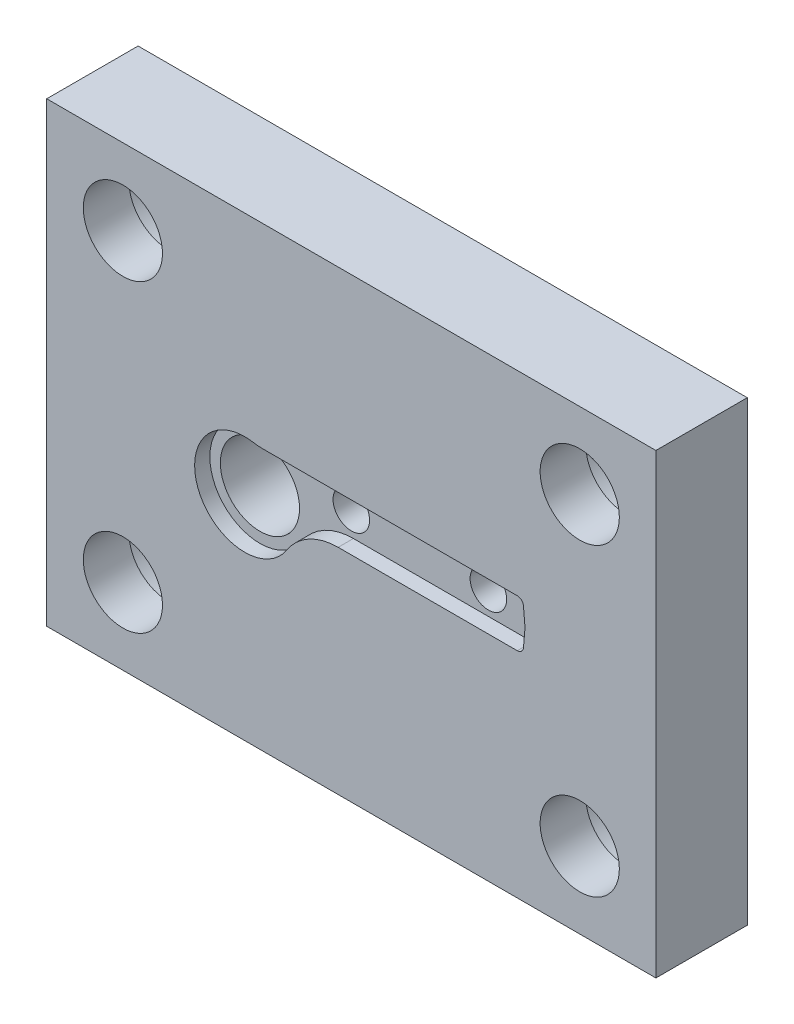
ISO-10303-21;
HEADER;
FILE_DESCRIPTION(('STEP AP214'),'2;1');
FILE_NAME('part.step','',(''),(''),'','','');
FILE_SCHEMA(('AUTOMOTIVE_DESIGN { 1 0 10303 214 1 1 1 1 }'));
ENDSEC;
DATA;
#1=APPLICATION_CONTEXT('core data for automotive mechanical design processes');
#2=APPLICATION_PROTOCOL_DEFINITION('international standard','automotive_design',2000,#1);
#3=PRODUCT_CONTEXT('',#1,'mechanical');
#4=PRODUCT('Part','Part','',(#3));
#5=PRODUCT_RELATED_PRODUCT_CATEGORY('part','',(#4));
#6=PRODUCT_DEFINITION_FORMATION('','',#4);
#7=PRODUCT_DEFINITION_CONTEXT('part definition',#1,'design');
#8=PRODUCT_DEFINITION('design','',#6,#7);
#9=PRODUCT_DEFINITION_SHAPE('','',#8);
#10=(LENGTH_UNIT() NAMED_UNIT(*) SI_UNIT(.MILLI.,.METRE.));
#11=(NAMED_UNIT(*) PLANE_ANGLE_UNIT() SI_UNIT($,.RADIAN.));
#12=(NAMED_UNIT(*) SI_UNIT($,.STERADIAN.) SOLID_ANGLE_UNIT());
#13=UNCERTAINTY_MEASURE_WITH_UNIT(LENGTH_MEASURE(1.E-05),#10,'distance_accuracy_value','');
#14=(GEOMETRIC_REPRESENTATION_CONTEXT(3) GLOBAL_UNCERTAINTY_ASSIGNED_CONTEXT((#13)) GLOBAL_UNIT_ASSIGNED_CONTEXT((#10,
#11,#12)) REPRESENTATION_CONTEXT('',''));
#15=CARTESIAN_POINT('',(0.,0.,0.));
#16=DIRECTION('',(0.,0.,1.));
#17=DIRECTION('',(1.,0.,0.));
#18=AXIS2_PLACEMENT_3D('',#15,#16,#17);
#19=CARTESIAN_POINT('',(0.,0.,30.));
#20=DIRECTION('',(1.,0.,0.));
#21=DIRECTION('',(0.,0.,-1.));
#22=AXIS2_PLACEMENT_3D('',#19,#20,#21);
#23=PLANE('',#22);
#24=DIRECTION('',(0.,-1.,0.));
#25=VECTOR('',#24,1.);
#26=CARTESIAN_POINT('',(0.,0.,0.));
#27=LINE('',#26,#25);
#28=CARTESIAN_POINT('',(0.,150.,0.));
#29=VERTEX_POINT('',#28);
#30=CARTESIAN_POINT('',(0.,0.,0.));
#31=VERTEX_POINT('',#30);
#32=EDGE_CURVE('E191',#29,#31,#27,.T.);
#33=ORIENTED_EDGE('',*,*,#32,.T.);
#34=DIRECTION('',(0.,0.,-1.));
#35=VECTOR('',#34,1.);
#36=CARTESIAN_POINT('',(0.,0.,30.));
#37=LINE('',#36,#35);
#38=CARTESIAN_POINT('',(0.,0.,30.));
#39=VERTEX_POINT('',#38);
#40=EDGE_CURVE('E11',#39,#31,#37,.T.);
#41=ORIENTED_EDGE('',*,*,#40,.F.);
#42=DIRECTION('',(0.,-1.,0.));
#43=VECTOR('',#42,1.);
#44=CARTESIAN_POINT('',(0.,0.,30.));
#45=LINE('',#44,#43);
#46=CARTESIAN_POINT('',(0.,150.,30.));
#47=VERTEX_POINT('',#46);
#48=EDGE_CURVE('E212',#47,#39,#45,.T.);
#49=ORIENTED_EDGE('',*,*,#48,.F.);
#50=DIRECTION('',(0.,0.,-1.));
#51=VECTOR('',#50,1.);
#52=CARTESIAN_POINT('',(0.,150.,30.));
#53=LINE('',#52,#51);
#54=EDGE_CURVE('E219',#47,#29,#53,.T.);
#55=ORIENTED_EDGE('',*,*,#54,.T.);
#56=EDGE_LOOP('',(#33,#41,#49,#55));
#57=FACE_BOUND('',#56,.T.);
#58=ADVANCED_FACE('F28',(#57),#23,.F.);
#59=CARTESIAN_POINT('',(0.,0.,30.));
#60=DIRECTION('',(0.,1.,0.));
#61=DIRECTION('',(0.,0.,1.));
#62=AXIS2_PLACEMENT_3D('',#59,#60,#61);
#63=PLANE('',#62);
#64=DIRECTION('',(1.,0.,0.));
#65=VECTOR('',#64,1.);
#66=CARTESIAN_POINT('',(0.,0.,0.));
#67=LINE('',#66,#65);
#68=CARTESIAN_POINT('',(200.,0.,0.));
#69=VERTEX_POINT('',#68);
#70=EDGE_CURVE('E206',#31,#69,#67,.T.);
#71=ORIENTED_EDGE('',*,*,#70,.T.);
#72=DIRECTION('',(0.,0.,-1.));
#73=VECTOR('',#72,1.);
#74=CARTESIAN_POINT('',(200.,0.,30.));
#75=LINE('',#74,#73);
#76=CARTESIAN_POINT('',(200.,0.,30.));
#77=VERTEX_POINT('',#76);
#78=EDGE_CURVE('E35',#77,#69,#75,.T.);
#79=ORIENTED_EDGE('',*,*,#78,.F.);
#80=DIRECTION('',(1.,0.,0.));
#81=VECTOR('',#80,1.);
#82=CARTESIAN_POINT('',(0.,0.,30.));
#83=LINE('',#82,#81);
#84=EDGE_CURVE('E214',#39,#77,#83,.T.);
#85=ORIENTED_EDGE('',*,*,#84,.F.);
#86=ORIENTED_EDGE('',*,*,#40,.T.);
#87=EDGE_LOOP('',(#71,#79,#85,#86));
#88=FACE_BOUND('',#87,.T.);
#89=ADVANCED_FACE('F241',(#88),#63,.F.);
#90=CARTESIAN_POINT('',(200.,0.,30.));
#91=DIRECTION('',(-1.,0.,0.));
#92=DIRECTION('',(0.,0.,1.));
#93=AXIS2_PLACEMENT_3D('',#90,#91,#92);
#94=PLANE('',#93);
#95=DIRECTION('',(0.,1.,0.));
#96=VECTOR('',#95,1.);
#97=CARTESIAN_POINT('',(200.,0.,0.));
#98=LINE('',#97,#96);
#99=CARTESIAN_POINT('',(200.,150.,0.));
#100=VERTEX_POINT('',#99);
#101=EDGE_CURVE('E208',#69,#100,#98,.T.);
#102=ORIENTED_EDGE('',*,*,#101,.T.);
#103=DIRECTION('',(0.,0.,-1.));
#104=VECTOR('',#103,1.);
#105=CARTESIAN_POINT('',(200.,150.,30.));
#106=LINE('',#105,#104);
#107=CARTESIAN_POINT('',(200.,150.,30.));
#108=VERTEX_POINT('',#107);
#109=EDGE_CURVE('E222',#108,#100,#106,.T.);
#110=ORIENTED_EDGE('',*,*,#109,.F.);
#111=DIRECTION('',(0.,1.,0.));
#112=VECTOR('',#111,1.);
#113=CARTESIAN_POINT('',(200.,0.,30.));
#114=LINE('',#113,#112);
#115=EDGE_CURVE('E216',#77,#108,#114,.T.);
#116=ORIENTED_EDGE('',*,*,#115,.F.);
#117=ORIENTED_EDGE('',*,*,#78,.T.);
#118=EDGE_LOOP('',(#102,#110,#116,#117));
#119=FACE_BOUND('',#118,.T.);
#120=ADVANCED_FACE('F229',(#119),#94,.F.);
#121=CARTESIAN_POINT('',(0.,150.,30.));
#122=DIRECTION('',(0.,-1.,0.));
#123=DIRECTION('',(0.,0.,-1.));
#124=AXIS2_PLACEMENT_3D('',#121,#122,#123);
#125=PLANE('',#124);
#126=DIRECTION('',(-1.,0.,0.));
#127=VECTOR('',#126,1.);
#128=CARTESIAN_POINT('',(0.,150.,0.));
#129=LINE('',#128,#127);
#130=EDGE_CURVE('E210',#100,#29,#129,.T.);
#131=ORIENTED_EDGE('',*,*,#130,.T.);
#132=ORIENTED_EDGE('',*,*,#54,.F.);
#133=DIRECTION('',(-1.,0.,0.));
#134=VECTOR('',#133,1.);
#135=CARTESIAN_POINT('',(0.,150.,30.));
#136=LINE('',#135,#134);
#137=EDGE_CURVE('E50',#108,#47,#136,.T.);
#138=ORIENTED_EDGE('',*,*,#137,.F.);
#139=ORIENTED_EDGE('',*,*,#109,.T.);
#140=EDGE_LOOP('',(#131,#132,#138,#139));
#141=FACE_BOUND('',#140,.T.);
#142=ADVANCED_FACE('F237',(#141),#125,.F.);
#143=CARTESIAN_POINT('',(0.,150.,30.));
#144=DIRECTION('',(0.,0.,-1.));
#145=DIRECTION('',(-1.,0.,0.));
#146=AXIS2_PLACEMENT_3D('',#143,#144,#145);
#147=PLANE('',#146);
#148=CARTESIAN_POINT('',(175.,125.,30.));
#149=DIRECTION('',(0.,0.,1.));
#150=DIRECTION('',(1.,0.,0.));
#151=AXIS2_PLACEMENT_3D('',#148,#149,#150);
#152=CIRCLE('',#151,13.);
#153=CARTESIAN_POINT('',(188.,125.,30.));
#154=VERTEX_POINT('',#153);
#155=EDGE_CURVE('E409',#154,#154,#152,.T.);
#156=ORIENTED_EDGE('',*,*,#155,.F.);
#157=EDGE_LOOP('',(#156));
#158=FACE_BOUND('',#157,.T.);
#159=CARTESIAN_POINT('',(175.,25.,30.));
#160=DIRECTION('',(0.,0.,1.));
#161=DIRECTION('',(1.,0.,0.));
#162=AXIS2_PLACEMENT_3D('',#159,#160,#161);
#163=CIRCLE('',#162,13.);
#164=CARTESIAN_POINT('',(188.,25.,30.));
#165=VERTEX_POINT('',#164);
#166=EDGE_CURVE('E412',#165,#165,#163,.T.);
#167=ORIENTED_EDGE('',*,*,#166,.F.);
#168=EDGE_LOOP('',(#167));
#169=FACE_BOUND('',#168,.T.);
#170=CARTESIAN_POINT('',(25.,25.,30.));
#171=DIRECTION('',(0.,0.,1.));
#172=DIRECTION('',(1.,0.,0.));
#173=AXIS2_PLACEMENT_3D('',#170,#171,#172);
#174=CIRCLE('',#173,13.);
#175=CARTESIAN_POINT('',(38.,25.,30.));
#176=VERTEX_POINT('',#175);
#177=EDGE_CURVE('E415',#176,#176,#174,.T.);
#178=ORIENTED_EDGE('',*,*,#177,.F.);
#179=EDGE_LOOP('',(#178));
#180=FACE_BOUND('',#179,.T.);
#181=CARTESIAN_POINT('',(25.,125.,30.));
#182=DIRECTION('',(0.,0.,1.));
#183=DIRECTION('',(1.,0.,0.));
#184=AXIS2_PLACEMENT_3D('',#181,#182,#183);
#185=CIRCLE('',#184,13.);
#186=CARTESIAN_POINT('',(38.,125.,30.));
#187=VERTEX_POINT('',#186);
#188=EDGE_CURVE('E418',#187,#187,#185,.T.);
#189=ORIENTED_EDGE('',*,*,#188,.F.);
#190=EDGE_LOOP('',(#189));
#191=FACE_BOUND('',#190,.T.);
#192=CARTESIAN_POINT('',(65.,70.,30.));
#193=DIRECTION('',(0.,0.,1.));
#194=DIRECTION('',(1.,0.,0.));
#195=AXIS2_PLACEMENT_3D('',#192,#193,#194);
#196=CIRCLE('',#195,16.445);
#197=CARTESIAN_POINT('',(67.7403932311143,86.2150630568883,30.));
#198=VERTEX_POINT('',#197);
#199=CARTESIAN_POINT('',(78.8329287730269,61.1068505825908,30.));
#200=VERTEX_POINT('',#199);
#201=EDGE_CURVE('E138',#198,#200,#196,.T.);
#202=ORIENTED_EDGE('',*,*,#201,.F.);
#203=CARTESIAN_POINT('',(71.0781905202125,105.965,30.));
#204=DIRECTION('',(0.,0.,-1.));
#205=DIRECTION('',(-1.,0.,0.));
#206=AXIS2_PLACEMENT_3D('',#203,#204,#205);
#207=CIRCLE('',#206,20.03);
#208=CARTESIAN_POINT('',(71.0781905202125,85.935,30.));
#209=VERTEX_POINT('',#208);
#210=EDGE_CURVE('E42',#209,#198,#207,.T.);
#211=ORIENTED_EDGE('',*,*,#210,.F.);
#212=DIRECTION('',(-1.,0.,0.));
#213=VECTOR('',#212,1.);
#214=CARTESIAN_POINT('',(71.0781905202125,85.935,30.));
#215=LINE('',#214,#213);
#216=CARTESIAN_POINT('',(154.489847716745,85.935,30.));
#217=VERTEX_POINT('',#216);
#218=EDGE_CURVE('E162',#217,#209,#215,.T.);
#219=ORIENTED_EDGE('',*,*,#218,.F.);
#220=CARTESIAN_POINT('',(154.489847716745,83.905,30.));
#221=DIRECTION('',(0.,0.,1.));
#222=DIRECTION('',(-1.,0.,0.));
#223=AXIS2_PLACEMENT_3D('',#220,#221,#222);
#224=CIRCLE('',#223,2.03000000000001);
#225=CARTESIAN_POINT('',(156.512122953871,84.0819261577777,30.));
#226=VERTEX_POINT('',#225);
#227=EDGE_CURVE('E159',#226,#217,#224,.T.);
#228=ORIENTED_EDGE('',*,*,#227,.F.);
#229=DIRECTION('',(-0.0871557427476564,0.996194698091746,0.));
#230=VECTOR('',#229,1.);
#231=CARTESIAN_POINT('',(156.512122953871,84.0819261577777,30.));
#232=LINE('',#231,#230);
#233=CARTESIAN_POINT('',(157.033723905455,78.12,30.));
#234=VERTEX_POINT('',#233);
#235=EDGE_CURVE('E156',#234,#226,#232,.T.);
#236=ORIENTED_EDGE('',*,*,#235,.F.);
#237=DIRECTION('',(0.0871557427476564,0.996194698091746,0.));
#238=VECTOR('',#237,1.);
#239=CARTESIAN_POINT('',(156.512122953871,72.1580738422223,30.));
#240=LINE('',#239,#238);
#241=CARTESIAN_POINT('',(156.512122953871,72.1580738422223,30.));
#242=VERTEX_POINT('',#241);
#243=EDGE_CURVE('E153',#242,#234,#240,.T.);
#244=ORIENTED_EDGE('',*,*,#243,.F.);
#245=CARTESIAN_POINT('',(154.489847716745,72.335,30.));
#246=DIRECTION('',(0.,0.,1.));
#247=DIRECTION('',(1.,0.,0.));
#248=AXIS2_PLACEMENT_3D('',#245,#246,#247);
#249=CIRCLE('',#248,2.03000000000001);
#250=CARTESIAN_POINT('',(154.489847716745,70.305,30.));
#251=VERTEX_POINT('',#250);
#252=EDGE_CURVE('E147',#251,#242,#249,.T.);
#253=ORIENTED_EDGE('',*,*,#252,.F.);
#254=DIRECTION('',(1.,0.,0.));
#255=VECTOR('',#254,1.);
#256=CARTESIAN_POINT('',(95.6814276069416,70.305,30.));
#257=LINE('',#256,#255);
#258=CARTESIAN_POINT('',(95.6814276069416,70.305,30.));
#259=VERTEX_POINT('',#258);
#260=EDGE_CURVE('E145',#259,#251,#257,.T.);
#261=ORIENTED_EDGE('',*,*,#260,.F.);
#262=CARTESIAN_POINT('',(95.6814276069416,50.275,30.));
#263=DIRECTION('',(0.,0.,-1.));
#264=DIRECTION('',(1.,0.,0.));
#265=AXIS2_PLACEMENT_3D('',#262,#263,#264);
#266=CIRCLE('',#265,20.03);
#267=EDGE_CURVE('E127',#200,#259,#266,.T.);
#268=ORIENTED_EDGE('',*,*,#267,.F.);
#269=EDGE_LOOP('',(#202,#211,#219,#228,#236,#244,#253,#261,#268));
#270=FACE_BOUND('',#269,.T.);
#271=ORIENTED_EDGE('',*,*,#48,.T.);
#272=ORIENTED_EDGE('',*,*,#84,.T.);
#273=ORIENTED_EDGE('',*,*,#115,.T.);
#274=ORIENTED_EDGE('',*,*,#137,.T.);
#275=EDGE_LOOP('',(#271,#272,#273,#274));
#276=FACE_BOUND('',#275,.T.);
#277=ADVANCED_FACE('F142',(#158,#169,#180,#191,#270,#276),#147,.F.);
#278=CARTESIAN_POINT('',(0.,150.,0.));
#279=DIRECTION('',(0.,0.,-1.));
#280=DIRECTION('',(-1.,0.,0.));
#281=AXIS2_PLACEMENT_3D('',#278,#279,#280);
#282=PLANE('',#281);
#283=CARTESIAN_POINT('',(25.,25.,0.));
#284=DIRECTION('',(0.,0.,1.));
#285=DIRECTION('',(1.,0.,0.));
#286=AXIS2_PLACEMENT_3D('',#283,#284,#285);
#287=CIRCLE('',#286,20.);
#288=CARTESIAN_POINT('',(45.,25.,0.));
#289=VERTEX_POINT('',#288);
#290=EDGE_CURVE('E377',#289,#289,#287,.T.);
#291=ORIENTED_EDGE('',*,*,#290,.T.);
#292=EDGE_LOOP('',(#291));
#293=FACE_BOUND('',#292,.T.);
#294=CARTESIAN_POINT('',(175.,25.,0.));
#295=DIRECTION('',(0.,0.,1.));
#296=DIRECTION('',(1.,0.,0.));
#297=AXIS2_PLACEMENT_3D('',#294,#295,#296);
#298=CIRCLE('',#297,20.);
#299=CARTESIAN_POINT('',(195.,25.,0.));
#300=VERTEX_POINT('',#299);
#301=EDGE_CURVE('E380',#300,#300,#298,.T.);
#302=ORIENTED_EDGE('',*,*,#301,.T.);
#303=EDGE_LOOP('',(#302));
#304=FACE_BOUND('',#303,.T.);
#305=CARTESIAN_POINT('',(175.,125.,0.));
#306=DIRECTION('',(0.,0.,1.));
#307=DIRECTION('',(1.,0.,0.));
#308=AXIS2_PLACEMENT_3D('',#305,#306,#307);
#309=CIRCLE('',#308,20.);
#310=CARTESIAN_POINT('',(195.,125.,0.));
#311=VERTEX_POINT('',#310);
#312=EDGE_CURVE('E394',#311,#311,#309,.T.);
#313=ORIENTED_EDGE('',*,*,#312,.T.);
#314=EDGE_LOOP('',(#313));
#315=FACE_BOUND('',#314,.T.);
#316=CARTESIAN_POINT('',(25.,125.,0.));
#317=DIRECTION('',(0.,0.,1.));
#318=DIRECTION('',(1.,0.,0.));
#319=AXIS2_PLACEMENT_3D('',#316,#317,#318);
#320=CIRCLE('',#319,20.);
#321=CARTESIAN_POINT('',(45.,125.,0.));
#322=VERTEX_POINT('',#321);
#323=EDGE_CURVE('E403',#322,#322,#320,.T.);
#324=ORIENTED_EDGE('',*,*,#323,.T.);
#325=EDGE_LOOP('',(#324));
#326=FACE_BOUND('',#325,.T.);
#327=CARTESIAN_POINT('',(95.,78.12,0.));
#328=DIRECTION('',(0.,0.,1.));
#329=DIRECTION('',(1.,0.,0.));
#330=AXIS2_PLACEMENT_3D('',#327,#328,#329);
#331=CIRCLE('',#330,8.99999999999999);
#332=CARTESIAN_POINT('',(104.,78.12,0.));
#333=VERTEX_POINT('',#332);
#334=EDGE_CURVE('E424',#333,#333,#331,.T.);
#335=ORIENTED_EDGE('',*,*,#334,.T.);
#336=EDGE_LOOP('',(#335));
#337=FACE_BOUND('',#336,.T.);
#338=CARTESIAN_POINT('',(140.,78.12,0.));
#339=DIRECTION('',(0.,0.,1.));
#340=DIRECTION('',(1.,0.,0.));
#341=AXIS2_PLACEMENT_3D('',#338,#339,#340);
#342=CIRCLE('',#341,9.00000000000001);
#343=CARTESIAN_POINT('',(149.,78.12,0.));
#344=VERTEX_POINT('',#343);
#345=EDGE_CURVE('E433',#344,#344,#342,.T.);
#346=ORIENTED_EDGE('',*,*,#345,.T.);
#347=EDGE_LOOP('',(#346));
#348=FACE_BOUND('',#347,.T.);
#349=CARTESIAN_POINT('',(65.,70.,0.));
#350=DIRECTION('',(0.,0.,1.));
#351=DIRECTION('',(1.,0.,0.));
#352=AXIS2_PLACEMENT_3D('',#349,#350,#351);
#353=CIRCLE('',#352,13.);
#354=CARTESIAN_POINT('',(78.,70.,0.));
#355=VERTEX_POINT('',#354);
#356=EDGE_CURVE('E448',#355,#355,#353,.T.);
#357=ORIENTED_EDGE('',*,*,#356,.T.);
#358=EDGE_LOOP('',(#357));
#359=FACE_BOUND('',#358,.T.);
#360=ORIENTED_EDGE('',*,*,#32,.F.);
#361=ORIENTED_EDGE('',*,*,#130,.F.);
#362=ORIENTED_EDGE('',*,*,#101,.F.);
#363=ORIENTED_EDGE('',*,*,#70,.F.);
#364=EDGE_LOOP('',(#360,#361,#362,#363));
#365=FACE_BOUND('',#364,.T.);
#366=ADVANCED_FACE('F235',(#293,#304,#315,#326,#337,#348,#359,#365),#282,.T.);
#367=CARTESIAN_POINT('',(71.0781905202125,105.965,25.));
#368=DIRECTION('',(0.,0.,1.));
#369=DIRECTION('',(1.,0.,0.));
#370=AXIS2_PLACEMENT_3D('',#367,#368,#369);
#371=CYLINDRICAL_SURFACE('',#370,20.03);
#372=ORIENTED_EDGE('',*,*,#210,.T.);
#373=DIRECTION('',(0.,0.,1.));
#374=VECTOR('',#373,1.);
#375=CARTESIAN_POINT('',(67.7403932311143,86.2150630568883,25.));
#376=LINE('',#375,#374);
#377=CARTESIAN_POINT('',(67.7403932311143,86.2150630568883,25.));
#378=VERTEX_POINT('',#377);
#379=EDGE_CURVE('E135',#378,#198,#376,.T.);
#380=ORIENTED_EDGE('',*,*,#379,.F.);
#381=CARTESIAN_POINT('',(71.0781905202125,105.965,25.));
#382=DIRECTION('',(0.,0.,-1.));
#383=DIRECTION('',(-1.,0.,0.));
#384=AXIS2_PLACEMENT_3D('',#381,#382,#383);
#385=CIRCLE('',#384,20.03);
#386=CARTESIAN_POINT('',(71.0781905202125,85.935,25.));
#387=VERTEX_POINT('',#386);
#388=EDGE_CURVE('E165',#387,#378,#385,.T.);
#389=ORIENTED_EDGE('',*,*,#388,.F.);
#390=DIRECTION('',(0.,0.,1.));
#391=VECTOR('',#390,1.);
#392=CARTESIAN_POINT('',(71.0781905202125,85.935,25.));
#393=LINE('',#392,#391);
#394=EDGE_CURVE('E189',#387,#209,#393,.T.);
#395=ORIENTED_EDGE('',*,*,#394,.T.);
#396=EDGE_LOOP('',(#372,#380,#389,#395));
#397=FACE_BOUND('',#396,.T.);
#398=ADVANCED_FACE('F256',(#397),#371,.T.);
#399=CARTESIAN_POINT('',(71.0781905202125,85.935,25.));
#400=DIRECTION('',(0.,1.,0.));
#401=DIRECTION('',(0.,0.,1.));
#402=AXIS2_PLACEMENT_3D('',#399,#400,#401);
#403=PLANE('',#402);
#404=ORIENTED_EDGE('',*,*,#218,.T.);
#405=ORIENTED_EDGE('',*,*,#394,.F.);
#406=DIRECTION('',(-1.,0.,0.));
#407=VECTOR('',#406,1.);
#408=CARTESIAN_POINT('',(71.0781905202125,85.935,25.));
#409=LINE('',#408,#407);
#410=CARTESIAN_POINT('',(154.489847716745,85.935,25.));
#411=VERTEX_POINT('',#410);
#412=EDGE_CURVE('E186',#411,#387,#409,.T.);
#413=ORIENTED_EDGE('',*,*,#412,.F.);
#414=DIRECTION('',(0.,0.,1.));
#415=VECTOR('',#414,1.);
#416=CARTESIAN_POINT('',(154.489847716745,85.935,25.));
#417=LINE('',#416,#415);
#418=EDGE_CURVE('E192',#411,#217,#417,.T.);
#419=ORIENTED_EDGE('',*,*,#418,.T.);
#420=EDGE_LOOP('',(#404,#405,#413,#419));
#421=FACE_BOUND('',#420,.T.);
#422=ADVANCED_FACE('F260',(#421),#403,.F.);
#423=CARTESIAN_POINT('',(154.489847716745,83.905,25.));
#424=DIRECTION('',(0.,0.,1.));
#425=DIRECTION('',(1.,0.,0.));
#426=AXIS2_PLACEMENT_3D('',#423,#424,#425);
#427=CYLINDRICAL_SURFACE('',#426,2.03000000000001);
#428=ORIENTED_EDGE('',*,*,#227,.T.);
#429=ORIENTED_EDGE('',*,*,#418,.F.);
#430=CARTESIAN_POINT('',(154.489847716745,83.905,25.));
#431=DIRECTION('',(0.,0.,1.));
#432=DIRECTION('',(-1.,0.,0.));
#433=AXIS2_PLACEMENT_3D('',#430,#431,#432);
#434=CIRCLE('',#433,2.03000000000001);
#435=CARTESIAN_POINT('',(156.512122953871,84.0819261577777,25.));
#436=VERTEX_POINT('',#435);
#437=EDGE_CURVE('E183',#436,#411,#434,.T.);
#438=ORIENTED_EDGE('',*,*,#437,.F.);
#439=DIRECTION('',(0.,0.,1.));
#440=VECTOR('',#439,1.);
#441=CARTESIAN_POINT('',(156.512122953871,84.0819261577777,25.));
#442=LINE('',#441,#440);
#443=EDGE_CURVE('E194',#436,#226,#442,.T.);
#444=ORIENTED_EDGE('',*,*,#443,.T.);
#445=EDGE_LOOP('',(#428,#429,#438,#444));
#446=FACE_BOUND('',#445,.T.);
#447=ADVANCED_FACE('F281',(#446),#427,.F.);
#448=CARTESIAN_POINT('',(156.512122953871,84.0819261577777,25.));
#449=DIRECTION('',(0.996194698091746,0.0871557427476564,0.));
#450=DIRECTION('',(-0.0871557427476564,0.996194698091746,0.));
#451=AXIS2_PLACEMENT_3D('',#448,#449,#450);
#452=PLANE('',#451);
#453=ORIENTED_EDGE('',*,*,#235,.T.);
#454=ORIENTED_EDGE('',*,*,#443,.F.);
#455=DIRECTION('',(-0.0871557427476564,0.996194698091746,0.));
#456=VECTOR('',#455,1.);
#457=CARTESIAN_POINT('',(156.512122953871,84.0819261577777,25.));
#458=LINE('',#457,#456);
#459=CARTESIAN_POINT('',(157.033723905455,78.12,25.));
#460=VERTEX_POINT('',#459);
#461=EDGE_CURVE('E180',#460,#436,#458,.T.);
#462=ORIENTED_EDGE('',*,*,#461,.F.);
#463=DIRECTION('',(0.,0.,1.));
#464=VECTOR('',#463,1.);
#465=CARTESIAN_POINT('',(157.033723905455,78.12,25.));
#466=LINE('',#465,#464);
#467=EDGE_CURVE('E196',#460,#234,#466,.T.);
#468=ORIENTED_EDGE('',*,*,#467,.T.);
#469=EDGE_LOOP('',(#453,#454,#462,#468));
#470=FACE_BOUND('',#469,.T.);
#471=ADVANCED_FACE('F277',(#470),#452,.F.);
#472=CARTESIAN_POINT('',(156.512122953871,72.1580738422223,25.));
#473=DIRECTION('',(0.996194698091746,-0.0871557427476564,0.));
#474=DIRECTION('',(0.0871557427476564,0.996194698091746,0.));
#475=AXIS2_PLACEMENT_3D('',#472,#473,#474);
#476=PLANE('',#475);
#477=ORIENTED_EDGE('',*,*,#243,.T.);
#478=ORIENTED_EDGE('',*,*,#467,.F.);
#479=DIRECTION('',(0.0871557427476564,0.996194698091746,0.));
#480=VECTOR('',#479,1.);
#481=CARTESIAN_POINT('',(156.512122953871,72.1580738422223,25.));
#482=LINE('',#481,#480);
#483=CARTESIAN_POINT('',(156.512122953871,72.1580738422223,25.));
#484=VERTEX_POINT('',#483);
#485=EDGE_CURVE('E177',#484,#460,#482,.T.);
#486=ORIENTED_EDGE('',*,*,#485,.F.);
#487=DIRECTION('',(0.,0.,1.));
#488=VECTOR('',#487,1.);
#489=CARTESIAN_POINT('',(156.512122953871,72.1580738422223,25.));
#490=LINE('',#489,#488);
#491=EDGE_CURVE('E198',#484,#242,#490,.T.);
#492=ORIENTED_EDGE('',*,*,#491,.T.);
#493=EDGE_LOOP('',(#477,#478,#486,#492));
#494=FACE_BOUND('',#493,.T.);
#495=ADVANCED_FACE('F273',(#494),#476,.F.);
#496=CARTESIAN_POINT('',(154.489847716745,72.335,25.));
#497=DIRECTION('',(0.,0.,1.));
#498=DIRECTION('',(1.,0.,0.));
#499=AXIS2_PLACEMENT_3D('',#496,#497,#498);
#500=CYLINDRICAL_SURFACE('',#499,2.03000000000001);
#501=ORIENTED_EDGE('',*,*,#252,.T.);
#502=ORIENTED_EDGE('',*,*,#491,.F.);
#503=CARTESIAN_POINT('',(154.489847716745,72.335,25.));
#504=DIRECTION('',(0.,0.,1.));
#505=DIRECTION('',(1.,0.,0.));
#506=AXIS2_PLACEMENT_3D('',#503,#504,#505);
#507=CIRCLE('',#506,2.03000000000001);
#508=CARTESIAN_POINT('',(154.489847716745,70.305,25.));
#509=VERTEX_POINT('',#508);
#510=EDGE_CURVE('E174',#509,#484,#507,.T.);
#511=ORIENTED_EDGE('',*,*,#510,.F.);
#512=DIRECTION('',(0.,0.,1.));
#513=VECTOR('',#512,1.);
#514=CARTESIAN_POINT('',(154.489847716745,70.305,25.));
#515=LINE('',#514,#513);
#516=EDGE_CURVE('E200',#509,#251,#515,.T.);
#517=ORIENTED_EDGE('',*,*,#516,.T.);
#518=EDGE_LOOP('',(#501,#502,#511,#517));
#519=FACE_BOUND('',#518,.T.);
#520=ADVANCED_FACE('F269',(#519),#500,.F.);
#521=CARTESIAN_POINT('',(95.6814276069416,70.305,25.));
#522=DIRECTION('',(0.,-1.,0.));
#523=DIRECTION('',(0.,0.,-1.));
#524=AXIS2_PLACEMENT_3D('',#521,#522,#523);
#525=PLANE('',#524);
#526=ORIENTED_EDGE('',*,*,#260,.T.);
#527=ORIENTED_EDGE('',*,*,#516,.F.);
#528=DIRECTION('',(1.,0.,0.));
#529=VECTOR('',#528,1.);
#530=CARTESIAN_POINT('',(95.6814276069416,70.305,25.));
#531=LINE('',#530,#529);
#532=CARTESIAN_POINT('',(95.6814276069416,70.305,25.));
#533=VERTEX_POINT('',#532);
#534=EDGE_CURVE('E171',#533,#509,#531,.T.);
#535=ORIENTED_EDGE('',*,*,#534,.F.);
#536=DIRECTION('',(0.,0.,1.));
#537=VECTOR('',#536,1.);
#538=CARTESIAN_POINT('',(95.6814276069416,70.305,25.));
#539=LINE('',#538,#537);
#540=EDGE_CURVE('E134',#533,#259,#539,.T.);
#541=ORIENTED_EDGE('',*,*,#540,.T.);
#542=EDGE_LOOP('',(#526,#527,#535,#541));
#543=FACE_BOUND('',#542,.T.);
#544=ADVANCED_FACE('F266',(#543),#525,.F.);
#545=CARTESIAN_POINT('',(95.6814276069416,50.275,25.));
#546=DIRECTION('',(0.,0.,1.));
#547=DIRECTION('',(1.,0.,0.));
#548=AXIS2_PLACEMENT_3D('',#545,#546,#547);
#549=CYLINDRICAL_SURFACE('',#548,20.03);
#550=ORIENTED_EDGE('',*,*,#267,.T.);
#551=ORIENTED_EDGE('',*,*,#540,.F.);
#552=CARTESIAN_POINT('',(95.6814276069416,50.275,25.));
#553=DIRECTION('',(0.,0.,-1.));
#554=DIRECTION('',(1.,0.,0.));
#555=AXIS2_PLACEMENT_3D('',#552,#553,#554);
#556=CIRCLE('',#555,20.03);
#557=CARTESIAN_POINT('',(78.8329287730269,61.1068505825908,25.));
#558=VERTEX_POINT('',#557);
#559=EDGE_CURVE('E130',#558,#533,#556,.T.);
#560=ORIENTED_EDGE('',*,*,#559,.F.);
#561=DIRECTION('',(0.,0.,1.));
#562=VECTOR('',#561,1.);
#563=CARTESIAN_POINT('',(78.8329287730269,61.1068505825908,25.));
#564=LINE('',#563,#562);
#565=EDGE_CURVE('E123',#558,#200,#564,.T.);
#566=ORIENTED_EDGE('',*,*,#565,.T.);
#567=EDGE_LOOP('',(#550,#551,#560,#566));
#568=FACE_BOUND('',#567,.T.);
#569=ADVANCED_FACE('F125',(#568),#549,.T.);
#570=CARTESIAN_POINT('',(65.,70.,25.));
#571=DIRECTION('',(0.,0.,1.));
#572=DIRECTION('',(1.,0.,0.));
#573=AXIS2_PLACEMENT_3D('',#570,#571,#572);
#574=CYLINDRICAL_SURFACE('',#573,16.445);
#575=ORIENTED_EDGE('',*,*,#201,.T.);
#576=ORIENTED_EDGE('',*,*,#565,.F.);
#577=CARTESIAN_POINT('',(65.,70.,25.));
#578=DIRECTION('',(0.,0.,1.));
#579=DIRECTION('',(1.,0.,0.));
#580=AXIS2_PLACEMENT_3D('',#577,#578,#579);
#581=CIRCLE('',#580,16.445);
#582=EDGE_CURVE('E168',#378,#558,#581,.T.);
#583=ORIENTED_EDGE('',*,*,#582,.F.);
#584=ORIENTED_EDGE('',*,*,#379,.T.);
#585=EDGE_LOOP('',(#575,#576,#583,#584));
#586=FACE_BOUND('',#585,.T.);
#587=ADVANCED_FACE('F139',(#586),#574,.F.);
#588=CARTESIAN_POINT('',(71.0781905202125,105.965,25.));
#589=DIRECTION('',(0.,0.,-1.));
#590=DIRECTION('',(-1.,0.,0.));
#591=AXIS2_PLACEMENT_3D('',#588,#589,#590);
#592=PLANE('',#591);
#593=CARTESIAN_POINT('',(95.,78.12,25.));
#594=DIRECTION('',(0.,0.,1.));
#595=DIRECTION('',(1.,0.,0.));
#596=AXIS2_PLACEMENT_3D('',#593,#594,#595);
#597=CIRCLE('',#596,6.);
#598=CARTESIAN_POINT('',(101.,78.12,25.));
#599=VERTEX_POINT('',#598);
#600=EDGE_CURVE('E439',#599,#599,#597,.T.);
#601=ORIENTED_EDGE('',*,*,#600,.F.);
#602=EDGE_LOOP('',(#601));
#603=FACE_BOUND('',#602,.T.);
#604=CARTESIAN_POINT('',(140.,78.12,25.));
#605=DIRECTION('',(0.,0.,1.));
#606=DIRECTION('',(1.,0.,0.));
#607=AXIS2_PLACEMENT_3D('',#604,#605,#606);
#608=CIRCLE('',#607,6.00000000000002);
#609=CARTESIAN_POINT('',(146.,78.12,25.));
#610=VERTEX_POINT('',#609);
#611=EDGE_CURVE('E442',#610,#610,#608,.T.);
#612=ORIENTED_EDGE('',*,*,#611,.F.);
#613=EDGE_LOOP('',(#612));
#614=FACE_BOUND('',#613,.T.);
#615=CARTESIAN_POINT('',(65.,70.,25.));
#616=DIRECTION('',(0.,0.,1.));
#617=DIRECTION('',(1.,0.,0.));
#618=AXIS2_PLACEMENT_3D('',#615,#616,#617);
#619=CIRCLE('',#618,13.);
#620=CARTESIAN_POINT('',(78.,70.,25.));
#621=VERTEX_POINT('',#620);
#622=EDGE_CURVE('E445',#621,#621,#619,.T.);
#623=ORIENTED_EDGE('',*,*,#622,.F.);
#624=EDGE_LOOP('',(#623));
#625=FACE_BOUND('',#624,.T.);
#626=ORIENTED_EDGE('',*,*,#388,.T.);
#627=ORIENTED_EDGE('',*,*,#582,.T.);
#628=ORIENTED_EDGE('',*,*,#559,.T.);
#629=ORIENTED_EDGE('',*,*,#534,.T.);
#630=ORIENTED_EDGE('',*,*,#510,.T.);
#631=ORIENTED_EDGE('',*,*,#485,.T.);
#632=ORIENTED_EDGE('',*,*,#461,.T.);
#633=ORIENTED_EDGE('',*,*,#437,.T.);
#634=ORIENTED_EDGE('',*,*,#412,.T.);
#635=EDGE_LOOP('',(#626,#627,#628,#629,#630,#631,#632,#633,#634));
#636=FACE_BOUND('',#635,.T.);
#637=ADVANCED_FACE('F263',(#603,#614,#625,#636),#592,.F.);
#638=CARTESIAN_POINT('',(65.,70.,0.));
#639=DIRECTION('',(0.,0.,1.));
#640=DIRECTION('',(1.,0.,0.));
#641=AXIS2_PLACEMENT_3D('',#638,#639,#640);
#642=CYLINDRICAL_SURFACE('',#641,13.);
#643=CARTESIAN_POINT('',(78.,70.,0.));
#644=CARTESIAN_POINT('',(78.,70.,0.260416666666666));
#645=CARTESIAN_POINT('',(78.,70.,0.520833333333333));
#646=CARTESIAN_POINT('',(78.,70.,1.04166666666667));
#647=CARTESIAN_POINT('',(78.,70.,1.30208333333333));
#648=CARTESIAN_POINT('',(78.,70.,1.82291666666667));
#649=CARTESIAN_POINT('',(78.,70.,2.08333333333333));
#650=CARTESIAN_POINT('',(78.,70.,2.60416666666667));
#651=CARTESIAN_POINT('',(78.,70.,2.86458333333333));
#652=CARTESIAN_POINT('',(78.,70.,3.38541666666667));
#653=CARTESIAN_POINT('',(78.,70.,3.64583333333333));
#654=CARTESIAN_POINT('',(78.,70.,4.16666666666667));
#655=CARTESIAN_POINT('',(78.,70.,4.42708333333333));
#656=CARTESIAN_POINT('',(78.,70.,4.94791666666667));
#657=CARTESIAN_POINT('',(78.,70.,5.20833333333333));
#658=CARTESIAN_POINT('',(78.,70.,5.72916666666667));
#659=CARTESIAN_POINT('',(78.,70.,5.98958333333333));
#660=CARTESIAN_POINT('',(78.,70.,6.51041666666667));
#661=CARTESIAN_POINT('',(78.,70.,6.77083333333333));
#662=CARTESIAN_POINT('',(78.,70.,7.29166666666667));
#663=CARTESIAN_POINT('',(78.,70.,7.55208333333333));
#664=CARTESIAN_POINT('',(78.,70.,8.07291666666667));
#665=CARTESIAN_POINT('',(78.,70.,8.33333333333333));
#666=CARTESIAN_POINT('',(78.,70.,8.85416666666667));
#667=CARTESIAN_POINT('',(78.,70.,9.11458333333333));
#668=CARTESIAN_POINT('',(78.,70.,9.63541666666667));
#669=CARTESIAN_POINT('',(78.,70.,9.89583333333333));
#670=CARTESIAN_POINT('',(78.,70.,10.4166666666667));
#671=CARTESIAN_POINT('',(78.,70.,10.6770833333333));
#672=CARTESIAN_POINT('',(78.,70.,11.1979166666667));
#673=CARTESIAN_POINT('',(78.,70.,11.4583333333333));
#674=CARTESIAN_POINT('',(78.,70.,11.9791666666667));
#675=CARTESIAN_POINT('',(78.,70.,12.2395833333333));
#676=CARTESIAN_POINT('',(78.,70.,12.7604166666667));
#677=CARTESIAN_POINT('',(78.,70.,13.0208333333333));
#678=CARTESIAN_POINT('',(78.,70.,13.5416666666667));
#679=CARTESIAN_POINT('',(78.,70.,13.8020833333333));
#680=CARTESIAN_POINT('',(78.,70.,14.3229166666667));
#681=CARTESIAN_POINT('',(78.,70.,14.5833333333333));
#682=CARTESIAN_POINT('',(78.,70.,15.1041666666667));
#683=CARTESIAN_POINT('',(78.,70.,15.3645833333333));
#684=CARTESIAN_POINT('',(78.,70.,15.8854166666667));
#685=CARTESIAN_POINT('',(78.,70.,16.1458333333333));
#686=CARTESIAN_POINT('',(78.,70.,16.6666666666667));
#687=CARTESIAN_POINT('',(78.,70.,16.9270833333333));
#688=CARTESIAN_POINT('',(78.,70.,17.4479166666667));
#689=CARTESIAN_POINT('',(78.,70.,17.7083333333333));
#690=CARTESIAN_POINT('',(78.,70.,18.2291666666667));
#691=CARTESIAN_POINT('',(78.,70.,18.4895833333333));
#692=CARTESIAN_POINT('',(78.,70.,19.0104166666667));
#693=CARTESIAN_POINT('',(78.,70.,19.2708333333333));
#694=CARTESIAN_POINT('',(78.,70.,19.7916666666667));
#695=CARTESIAN_POINT('',(78.,70.,20.0520833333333));
#696=CARTESIAN_POINT('',(78.,70.,20.5729166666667));
#697=CARTESIAN_POINT('',(78.,70.,20.8333333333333));
#698=CARTESIAN_POINT('',(78.,70.,21.3541666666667));
#699=CARTESIAN_POINT('',(78.,70.,21.6145833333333));
#700=CARTESIAN_POINT('',(78.,70.,22.1354166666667));
#701=CARTESIAN_POINT('',(78.,70.,22.3958333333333));
#702=CARTESIAN_POINT('',(78.,70.,22.9166666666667));
#703=CARTESIAN_POINT('',(78.,70.,23.1770833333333));
#704=CARTESIAN_POINT('',(78.,70.,23.6979166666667));
#705=CARTESIAN_POINT('',(78.,70.,23.9583333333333));
#706=CARTESIAN_POINT('',(78.,70.,24.4791666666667));
#707=CARTESIAN_POINT('',(78.,70.,24.7395833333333));
#708=CARTESIAN_POINT('',(78.,70.,25.));
#709=B_SPLINE_CURVE_WITH_KNOTS('',3,(#643,#644,#645,#646,#647,#648,#649,#650,#651,#652,#653,
#654,#655,#656,#657,#658,#659,#660,#661,#662,#663,#664,#665,#666,#667,#668,#669,#670,#671,#672,
#673,#674,#675,#676,#677,#678,#679,#680,#681,#682,#683,#684,#685,#686,#687,#688,#689,#690,#691,
#692,#693,#694,#695,#696,#697,#698,#699,#700,#701,#702,#703,#704,#705,#706,#707,#708),
.UNSPECIFIED.,.F.,.F.,(4,2,2,2,2,2,2,2,2,2,2,2,2,2,2,2,2,2,2,2,2,2,2,2,2,2,2,2,2,2,2,2,4),(0.,
0.78125,1.5625,2.34375,3.125,3.90625,4.6875,5.46875,6.25,7.03125,7.8125,8.59375,9.375,10.15625,
10.9375,11.71875,12.5,13.28125,14.0625,14.84375,15.625,16.40625,17.1875,17.96875,18.75,19.53125,
20.3125,21.09375,21.875,22.65625,23.4375,24.21875,25.),.UNSPECIFIED.);
#710=EDGE_CURVE('BSEAM291',#355,#621,#709,.T.);
#711=ORIENTED_EDGE('',*,*,#356,.F.);
#712=ORIENTED_EDGE('',*,*,#622,.T.);
#713=ORIENTED_EDGE('',*,*,#710,.T.);
#714=ORIENTED_EDGE('',*,*,#710,.F.);
#715=EDGE_LOOP('',(#711,#713,#712,#714));
#716=FACE_BOUND('',#715,.T.);
#717=ADVANCED_FACE('F291',(#716),#642,.F.);
#718=CARTESIAN_POINT('',(140.,78.12,12.));
#719=DIRECTION('',(0.,0.,1.));
#720=DIRECTION('',(1.,0.,0.));
#721=AXIS2_PLACEMENT_3D('',#718,#719,#720);
#722=CYLINDRICAL_SURFACE('',#721,6.00000000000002);
#723=CARTESIAN_POINT('',(140.,78.12,12.));
#724=DIRECTION('',(0.,0.,1.));
#725=DIRECTION('',(1.,0.,0.));
#726=AXIS2_PLACEMENT_3D('',#723,#724,#725);
#727=CIRCLE('',#726,6.00000000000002);
#728=CARTESIAN_POINT('',(146.,78.12,12.));
#729=VERTEX_POINT('',#728);
#730=EDGE_CURVE('E436',#729,#729,#727,.F.);
#731=CARTESIAN_POINT('',(146.,78.12,12.));
#732=CARTESIAN_POINT('',(146.,78.12,12.1354166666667));
#733=CARTESIAN_POINT('',(146.,78.12,12.2708333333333));
#734=CARTESIAN_POINT('',(146.,78.12,12.5416666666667));
#735=CARTESIAN_POINT('',(146.,78.12,12.6770833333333));
#736=CARTESIAN_POINT('',(146.,78.12,12.9479166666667));
#737=CARTESIAN_POINT('',(146.,78.12,13.0833333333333));
#738=CARTESIAN_POINT('',(146.,78.12,13.3541666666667));
#739=CARTESIAN_POINT('',(146.,78.12,13.4895833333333));
#740=CARTESIAN_POINT('',(146.,78.12,13.7604166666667));
#741=CARTESIAN_POINT('',(146.,78.12,13.8958333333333));
#742=CARTESIAN_POINT('',(146.,78.12,14.1666666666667));
#743=CARTESIAN_POINT('',(146.,78.12,14.3020833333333));
#744=CARTESIAN_POINT('',(146.,78.12,14.5729166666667));
#745=CARTESIAN_POINT('',(146.,78.12,14.7083333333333));
#746=CARTESIAN_POINT('',(146.,78.12,14.9791666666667));
#747=CARTESIAN_POINT('',(146.,78.12,15.1145833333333));
#748=CARTESIAN_POINT('',(146.,78.12,15.3854166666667));
#749=CARTESIAN_POINT('',(146.,78.12,15.5208333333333));
#750=CARTESIAN_POINT('',(146.,78.12,15.7916666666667));
#751=CARTESIAN_POINT('',(146.,78.12,15.9270833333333));
#752=CARTESIAN_POINT('',(146.,78.12,16.1979166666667));
#753=CARTESIAN_POINT('',(146.,78.12,16.3333333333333));
#754=CARTESIAN_POINT('',(146.,78.12,16.6041666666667));
#755=CARTESIAN_POINT('',(146.,78.12,16.7395833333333));
#756=CARTESIAN_POINT('',(146.,78.12,17.0104166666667));
#757=CARTESIAN_POINT('',(146.,78.12,17.1458333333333));
#758=CARTESIAN_POINT('',(146.,78.12,17.4166666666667));
#759=CARTESIAN_POINT('',(146.,78.12,17.5520833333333));
#760=CARTESIAN_POINT('',(146.,78.12,17.8229166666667));
#761=CARTESIAN_POINT('',(146.,78.12,17.9583333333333));
#762=CARTESIAN_POINT('',(146.,78.12,18.2291666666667));
#763=CARTESIAN_POINT('',(146.,78.12,18.3645833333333));
#764=CARTESIAN_POINT('',(146.,78.12,18.6354166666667));
#765=CARTESIAN_POINT('',(146.,78.12,18.7708333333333));
#766=CARTESIAN_POINT('',(146.,78.12,19.0416666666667));
#767=CARTESIAN_POINT('',(146.,78.12,19.1770833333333));
#768=CARTESIAN_POINT('',(146.,78.12,19.4479166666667));
#769=CARTESIAN_POINT('',(146.,78.12,19.5833333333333));
#770=CARTESIAN_POINT('',(146.,78.12,19.8541666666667));
#771=CARTESIAN_POINT('',(146.,78.12,19.9895833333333));
#772=CARTESIAN_POINT('',(146.,78.12,20.2604166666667));
#773=CARTESIAN_POINT('',(146.,78.12,20.3958333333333));
#774=CARTESIAN_POINT('',(146.,78.12,20.6666666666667));
#775=CARTESIAN_POINT('',(146.,78.12,20.8020833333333));
#776=CARTESIAN_POINT('',(146.,78.12,21.0729166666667));
#777=CARTESIAN_POINT('',(146.,78.12,21.2083333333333));
#778=CARTESIAN_POINT('',(146.,78.12,21.4791666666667));
#779=CARTESIAN_POINT('',(146.,78.12,21.6145833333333));
#780=CARTESIAN_POINT('',(146.,78.12,21.8854166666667));
#781=CARTESIAN_POINT('',(146.,78.12,22.0208333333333));
#782=CARTESIAN_POINT('',(146.,78.12,22.2916666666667));
#783=CARTESIAN_POINT('',(146.,78.12,22.4270833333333));
#784=CARTESIAN_POINT('',(146.,78.12,22.6979166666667));
#785=CARTESIAN_POINT('',(146.,78.12,22.8333333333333));
#786=CARTESIAN_POINT('',(146.,78.12,23.1041666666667));
#787=CARTESIAN_POINT('',(146.,78.12,23.2395833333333));
#788=CARTESIAN_POINT('',(146.,78.12,23.5104166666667));
#789=CARTESIAN_POINT('',(146.,78.12,23.6458333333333));
#790=CARTESIAN_POINT('',(146.,78.12,23.9166666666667));
#791=CARTESIAN_POINT('',(146.,78.12,24.0520833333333));
#792=CARTESIAN_POINT('',(146.,78.12,24.3229166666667));
#793=CARTESIAN_POINT('',(146.,78.12,24.4583333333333));
#794=CARTESIAN_POINT('',(146.,78.12,24.7291666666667));
#795=CARTESIAN_POINT('',(146.,78.12,24.8645833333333));
#796=CARTESIAN_POINT('',(146.,78.12,25.));
#797=B_SPLINE_CURVE_WITH_KNOTS('',3,(#731,#732,#733,#734,#735,#736,#737,#738,#739,#740,#741,
#742,#743,#744,#745,#746,#747,#748,#749,#750,#751,#752,#753,#754,#755,#756,#757,#758,#759,#760,
#761,#762,#763,#764,#765,#766,#767,#768,#769,#770,#771,#772,#773,#774,#775,#776,#777,#778,#779,
#780,#781,#782,#783,#784,#785,#786,#787,#788,#789,#790,#791,#792,#793,#794,#795,#796),
.UNSPECIFIED.,.F.,.F.,(4,2,2,2,2,2,2,2,2,2,2,2,2,2,2,2,2,2,2,2,2,2,2,2,2,2,2,2,2,2,2,2,4),(0.,
0.40625,0.812500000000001,1.21875,1.625,2.03125,2.4375,2.84375,3.25,3.65625,4.0625,4.46875,
4.875,5.28125,5.6875,6.09375,6.5,6.90625,7.3125,7.71875,8.125,8.53125,8.9375,9.34375,9.75,
10.15625,10.5625,10.96875,11.375,11.78125,12.1875,12.59375,13.),.UNSPECIFIED.);
#798=EDGE_CURVE('BSEAM295',#729,#610,#797,.T.);
#799=ORIENTED_EDGE('',*,*,#730,.T.);
#800=ORIENTED_EDGE('',*,*,#611,.T.);
#801=ORIENTED_EDGE('',*,*,#798,.T.);
#802=ORIENTED_EDGE('',*,*,#798,.F.);
#803=EDGE_LOOP('',(#799,#801,#800,#802));
#804=FACE_BOUND('',#803,.T.);
#805=ADVANCED_FACE('F295',(#804),#722,.F.);
#806=CARTESIAN_POINT('',(95.,78.12,12.));
#807=DIRECTION('',(0.,0.,1.));
#808=DIRECTION('',(1.,0.,0.));
#809=AXIS2_PLACEMENT_3D('',#806,#807,#808);
#810=CYLINDRICAL_SURFACE('',#809,6.);
#811=CARTESIAN_POINT('',(95.,78.12,12.));
#812=DIRECTION('',(0.,0.,1.));
#813=DIRECTION('',(1.,0.,0.));
#814=AXIS2_PLACEMENT_3D('',#811,#812,#813);
#815=CIRCLE('',#814,6.);
#816=CARTESIAN_POINT('',(101.,78.12,12.));
#817=VERTEX_POINT('',#816);
#818=EDGE_CURVE('E427',#817,#817,#815,.F.);
#819=CARTESIAN_POINT('',(101.,78.12,12.));
#820=CARTESIAN_POINT('',(101.,78.12,12.1354166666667));
#821=CARTESIAN_POINT('',(101.,78.12,12.2708333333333));
#822=CARTESIAN_POINT('',(101.,78.12,12.5416666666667));
#823=CARTESIAN_POINT('',(101.,78.12,12.6770833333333));
#824=CARTESIAN_POINT('',(101.,78.12,12.9479166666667));
#825=CARTESIAN_POINT('',(101.,78.12,13.0833333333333));
#826=CARTESIAN_POINT('',(101.,78.12,13.3541666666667));
#827=CARTESIAN_POINT('',(101.,78.12,13.4895833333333));
#828=CARTESIAN_POINT('',(101.,78.12,13.7604166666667));
#829=CARTESIAN_POINT('',(101.,78.12,13.8958333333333));
#830=CARTESIAN_POINT('',(101.,78.12,14.1666666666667));
#831=CARTESIAN_POINT('',(101.,78.12,14.3020833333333));
#832=CARTESIAN_POINT('',(101.,78.12,14.5729166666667));
#833=CARTESIAN_POINT('',(101.,78.12,14.7083333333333));
#834=CARTESIAN_POINT('',(101.,78.12,14.9791666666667));
#835=CARTESIAN_POINT('',(101.,78.12,15.1145833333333));
#836=CARTESIAN_POINT('',(101.,78.12,15.3854166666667));
#837=CARTESIAN_POINT('',(101.,78.12,15.5208333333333));
#838=CARTESIAN_POINT('',(101.,78.12,15.7916666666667));
#839=CARTESIAN_POINT('',(101.,78.12,15.9270833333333));
#840=CARTESIAN_POINT('',(101.,78.12,16.1979166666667));
#841=CARTESIAN_POINT('',(101.,78.12,16.3333333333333));
#842=CARTESIAN_POINT('',(101.,78.12,16.6041666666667));
#843=CARTESIAN_POINT('',(101.,78.12,16.7395833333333));
#844=CARTESIAN_POINT('',(101.,78.12,17.0104166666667));
#845=CARTESIAN_POINT('',(101.,78.12,17.1458333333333));
#846=CARTESIAN_POINT('',(101.,78.12,17.4166666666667));
#847=CARTESIAN_POINT('',(101.,78.12,17.5520833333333));
#848=CARTESIAN_POINT('',(101.,78.12,17.8229166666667));
#849=CARTESIAN_POINT('',(101.,78.12,17.9583333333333));
#850=CARTESIAN_POINT('',(101.,78.12,18.2291666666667));
#851=CARTESIAN_POINT('',(101.,78.12,18.3645833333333));
#852=CARTESIAN_POINT('',(101.,78.12,18.6354166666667));
#853=CARTESIAN_POINT('',(101.,78.12,18.7708333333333));
#854=CARTESIAN_POINT('',(101.,78.12,19.0416666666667));
#855=CARTESIAN_POINT('',(101.,78.12,19.1770833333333));
#856=CARTESIAN_POINT('',(101.,78.12,19.4479166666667));
#857=CARTESIAN_POINT('',(101.,78.12,19.5833333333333));
#858=CARTESIAN_POINT('',(101.,78.12,19.8541666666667));
#859=CARTESIAN_POINT('',(101.,78.12,19.9895833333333));
#860=CARTESIAN_POINT('',(101.,78.12,20.2604166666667));
#861=CARTESIAN_POINT('',(101.,78.12,20.3958333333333));
#862=CARTESIAN_POINT('',(101.,78.12,20.6666666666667));
#863=CARTESIAN_POINT('',(101.,78.12,20.8020833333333));
#864=CARTESIAN_POINT('',(101.,78.12,21.0729166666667));
#865=CARTESIAN_POINT('',(101.,78.12,21.2083333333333));
#866=CARTESIAN_POINT('',(101.,78.12,21.4791666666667));
#867=CARTESIAN_POINT('',(101.,78.12,21.6145833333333));
#868=CARTESIAN_POINT('',(101.,78.12,21.8854166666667));
#869=CARTESIAN_POINT('',(101.,78.12,22.0208333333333));
#870=CARTESIAN_POINT('',(101.,78.12,22.2916666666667));
#871=CARTESIAN_POINT('',(101.,78.12,22.4270833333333));
#872=CARTESIAN_POINT('',(101.,78.12,22.6979166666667));
#873=CARTESIAN_POINT('',(101.,78.12,22.8333333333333));
#874=CARTESIAN_POINT('',(101.,78.12,23.1041666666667));
#875=CARTESIAN_POINT('',(101.,78.12,23.2395833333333));
#876=CARTESIAN_POINT('',(101.,78.12,23.5104166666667));
#877=CARTESIAN_POINT('',(101.,78.12,23.6458333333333));
#878=CARTESIAN_POINT('',(101.,78.12,23.9166666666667));
#879=CARTESIAN_POINT('',(101.,78.12,24.0520833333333));
#880=CARTESIAN_POINT('',(101.,78.12,24.3229166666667));
#881=CARTESIAN_POINT('',(101.,78.12,24.4583333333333));
#882=CARTESIAN_POINT('',(101.,78.12,24.7291666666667));
#883=CARTESIAN_POINT('',(101.,78.12,24.8645833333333));
#884=CARTESIAN_POINT('',(101.,78.12,25.));
#885=B_SPLINE_CURVE_WITH_KNOTS('',3,(#819,#820,#821,#822,#823,#824,#825,#826,#827,#828,#829,
#830,#831,#832,#833,#834,#835,#836,#837,#838,#839,#840,#841,#842,#843,#844,#845,#846,#847,#848,
#849,#850,#851,#852,#853,#854,#855,#856,#857,#858,#859,#860,#861,#862,#863,#864,#865,#866,#867,
#868,#869,#870,#871,#872,#873,#874,#875,#876,#877,#878,#879,#880,#881,#882,#883,#884),
.UNSPECIFIED.,.F.,.F.,(4,2,2,2,2,2,2,2,2,2,2,2,2,2,2,2,2,2,2,2,2,2,2,2,2,2,2,2,2,2,2,2,4),(0.,
0.40625,0.812500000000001,1.21875,1.625,2.03125,2.4375,2.84375,3.25,3.65625,4.0625,4.46875,
4.875,5.28125,5.6875,6.09375,6.5,6.90625,7.3125,7.71875,8.125,8.53125,8.9375,9.34375,9.75,
10.15625,10.5625,10.96875,11.375,11.78125,12.1875,12.59375,13.),.UNSPECIFIED.);
#886=EDGE_CURVE('BSEAM299',#817,#599,#885,.T.);
#887=ORIENTED_EDGE('',*,*,#818,.T.);
#888=ORIENTED_EDGE('',*,*,#600,.T.);
#889=ORIENTED_EDGE('',*,*,#886,.T.);
#890=ORIENTED_EDGE('',*,*,#886,.F.);
#891=EDGE_LOOP('',(#887,#889,#888,#890));
#892=FACE_BOUND('',#891,.T.);
#893=ADVANCED_FACE('F299',(#892),#810,.F.);
#894=CARTESIAN_POINT('',(140.,78.12,12.));
#895=DIRECTION('',(0.,0.,1.));
#896=DIRECTION('',(1.,0.,0.));
#897=AXIS2_PLACEMENT_3D('',#894,#895,#896);
#898=PLANE('',#897);
#899=CARTESIAN_POINT('',(140.,78.12,12.));
#900=DIRECTION('',(0.,0.,1.));
#901=DIRECTION('',(1.,0.,0.));
#902=AXIS2_PLACEMENT_3D('',#899,#900,#901);
#903=CIRCLE('',#902,9.00000000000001);
#904=CARTESIAN_POINT('',(149.,78.12,12.));
#905=VERTEX_POINT('',#904);
#906=EDGE_CURVE('E430',#905,#905,#903,.T.);
#907=ORIENTED_EDGE('',*,*,#906,.F.);
#908=EDGE_LOOP('',(#907));
#909=FACE_BOUND('',#908,.T.);
#910=ORIENTED_EDGE('',*,*,#730,.F.);
#911=EDGE_LOOP('',(#910));
#912=FACE_BOUND('',#911,.T.);
#913=ADVANCED_FACE('F303',(#909,#912),#898,.F.);
#914=CARTESIAN_POINT('',(140.,78.12,0.));
#915=DIRECTION('',(0.,0.,1.));
#916=DIRECTION('',(1.,0.,0.));
#917=AXIS2_PLACEMENT_3D('',#914,#915,#916);
#918=CYLINDRICAL_SURFACE('',#917,9.00000000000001);
#919=ORIENTED_EDGE('',*,*,#345,.F.);
#920=EDGE_LOOP('',(#919));
#921=FACE_BOUND('',#920,.T.);
#922=ORIENTED_EDGE('',*,*,#906,.T.);
#923=EDGE_LOOP('',(#922));
#924=FACE_BOUND('',#923,.T.);
#925=ADVANCED_FACE('F305',(#921,#924),#918,.F.);
#926=CARTESIAN_POINT('',(95.,78.12,12.));
#927=DIRECTION('',(0.,0.,1.));
#928=DIRECTION('',(1.,0.,0.));
#929=AXIS2_PLACEMENT_3D('',#926,#927,#928);
#930=PLANE('',#929);
#931=CARTESIAN_POINT('',(95.,78.12,12.));
#932=DIRECTION('',(0.,0.,1.));
#933=DIRECTION('',(1.,0.,0.));
#934=AXIS2_PLACEMENT_3D('',#931,#932,#933);
#935=CIRCLE('',#934,8.99999999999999);
#936=CARTESIAN_POINT('',(104.,78.12,12.));
#937=VERTEX_POINT('',#936);
#938=EDGE_CURVE('E421',#937,#937,#935,.T.);
#939=ORIENTED_EDGE('',*,*,#938,.F.);
#940=EDGE_LOOP('',(#939));
#941=FACE_BOUND('',#940,.T.);
#942=ORIENTED_EDGE('',*,*,#818,.F.);
#943=EDGE_LOOP('',(#942));
#944=FACE_BOUND('',#943,.T.);
#945=ADVANCED_FACE('F308',(#941,#944),#930,.F.);
#946=CARTESIAN_POINT('',(95.,78.12,0.));
#947=DIRECTION('',(0.,0.,1.));
#948=DIRECTION('',(1.,0.,0.));
#949=AXIS2_PLACEMENT_3D('',#946,#947,#948);
#950=CYLINDRICAL_SURFACE('',#949,8.99999999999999);
#951=ORIENTED_EDGE('',*,*,#334,.F.);
#952=EDGE_LOOP('',(#951));
#953=FACE_BOUND('',#952,.T.);
#954=ORIENTED_EDGE('',*,*,#938,.T.);
#955=EDGE_LOOP('',(#954));
#956=FACE_BOUND('',#955,.T.);
#957=ADVANCED_FACE('F313',(#953,#956),#950,.F.);
#958=CARTESIAN_POINT('',(25.,125.,15.));
#959=DIRECTION('',(0.,0.,1.));
#960=DIRECTION('',(1.,0.,0.));
#961=AXIS2_PLACEMENT_3D('',#958,#959,#960);
#962=CYLINDRICAL_SURFACE('',#961,13.);
#963=CARTESIAN_POINT('',(25.,125.,15.));
#964=DIRECTION('',(0.,0.,1.));
#965=DIRECTION('',(1.,0.,0.));
#966=AXIS2_PLACEMENT_3D('',#963,#964,#965);
#967=CIRCLE('',#966,13.);
#968=CARTESIAN_POINT('',(38.,125.,15.));
#969=VERTEX_POINT('',#968);
#970=EDGE_CURVE('E406',#969,#969,#967,.F.);
#971=ORIENTED_EDGE('',*,*,#970,.T.);
#972=EDGE_LOOP('',(#971));
#973=FACE_BOUND('',#972,.T.);
#974=ORIENTED_EDGE('',*,*,#188,.T.);
#975=EDGE_LOOP('',(#974));
#976=FACE_BOUND('',#975,.T.);
#977=ADVANCED_FACE('F316',(#973,#976),#962,.F.);
#978=CARTESIAN_POINT('',(25.,25.,15.));
#979=DIRECTION('',(0.,0.,1.));
#980=DIRECTION('',(1.,0.,0.));
#981=AXIS2_PLACEMENT_3D('',#978,#979,#980);
#982=CYLINDRICAL_SURFACE('',#981,13.);
#983=CARTESIAN_POINT('',(25.,25.,15.));
#984=DIRECTION('',(0.,0.,1.));
#985=DIRECTION('',(1.,0.,0.));
#986=AXIS2_PLACEMENT_3D('',#983,#984,#985);
#987=CIRCLE('',#986,13.);
#988=CARTESIAN_POINT('',(38.,25.,15.));
#989=VERTEX_POINT('',#988);
#990=EDGE_CURVE('E375',#989,#989,#987,.F.);
#991=ORIENTED_EDGE('',*,*,#990,.T.);
#992=EDGE_LOOP('',(#991));
#993=FACE_BOUND('',#992,.T.);
#994=ORIENTED_EDGE('',*,*,#177,.T.);
#995=EDGE_LOOP('',(#994));
#996=FACE_BOUND('',#995,.T.);
#997=ADVANCED_FACE('F323',(#993,#996),#982,.F.);
#998=CARTESIAN_POINT('',(175.,25.,15.));
#999=DIRECTION('',(0.,0.,1.));
#1000=DIRECTION('',(1.,0.,0.));
#1001=AXIS2_PLACEMENT_3D('',#998,#999,#1000);
#1002=CYLINDRICAL_SURFACE('',#1001,13.);
#1003=CARTESIAN_POINT('',(175.,25.,15.));
#1004=DIRECTION('',(0.,0.,1.));
#1005=DIRECTION('',(1.,0.,0.));
#1006=AXIS2_PLACEMENT_3D('',#1003,#1004,#1005);
#1007=CIRCLE('',#1006,13.);
#1008=CARTESIAN_POINT('',(188.,25.,15.));
#1009=VERTEX_POINT('',#1008);
#1010=EDGE_CURVE('E388',#1009,#1009,#1007,.F.);
#1011=ORIENTED_EDGE('',*,*,#1010,.T.);
#1012=EDGE_LOOP('',(#1011));
#1013=FACE_BOUND('',#1012,.T.);
#1014=ORIENTED_EDGE('',*,*,#166,.T.);
#1015=EDGE_LOOP('',(#1014));
#1016=FACE_BOUND('',#1015,.T.);
#1017=ADVANCED_FACE('F327',(#1013,#1016),#1002,.F.);
#1018=CARTESIAN_POINT('',(175.,125.,15.));
#1019=DIRECTION('',(0.,0.,1.));
#1020=DIRECTION('',(1.,0.,0.));
#1021=AXIS2_PLACEMENT_3D('',#1018,#1019,#1020);
#1022=CYLINDRICAL_SURFACE('',#1021,13.);
#1023=CARTESIAN_POINT('',(175.,125.,15.));
#1024=DIRECTION('',(0.,0.,1.));
#1025=DIRECTION('',(1.,0.,0.));
#1026=AXIS2_PLACEMENT_3D('',#1023,#1024,#1025);
#1027=CIRCLE('',#1026,13.);
#1028=CARTESIAN_POINT('',(188.,125.,15.));
#1029=VERTEX_POINT('',#1028);
#1030=EDGE_CURVE('E397',#1029,#1029,#1027,.F.);
#1031=ORIENTED_EDGE('',*,*,#1030,.T.);
#1032=EDGE_LOOP('',(#1031));
#1033=FACE_BOUND('',#1032,.T.);
#1034=ORIENTED_EDGE('',*,*,#155,.T.);
#1035=EDGE_LOOP('',(#1034));
#1036=FACE_BOUND('',#1035,.T.);
#1037=ADVANCED_FACE('F331',(#1033,#1036),#1022,.F.);
#1038=CARTESIAN_POINT('',(25.,125.,15.));
#1039=DIRECTION('',(0.,0.,1.));
#1040=DIRECTION('',(1.,0.,0.));
#1041=AXIS2_PLACEMENT_3D('',#1038,#1039,#1040);
#1042=PLANE('',#1041);
#1043=CARTESIAN_POINT('',(25.,125.,15.));
#1044=DIRECTION('',(0.,0.,1.));
#1045=DIRECTION('',(1.,0.,0.));
#1046=AXIS2_PLACEMENT_3D('',#1043,#1044,#1045);
#1047=CIRCLE('',#1046,20.);
#1048=CARTESIAN_POINT('',(45.,125.,15.));
#1049=VERTEX_POINT('',#1048);
#1050=EDGE_CURVE('E400',#1049,#1049,#1047,.T.);
#1051=ORIENTED_EDGE('',*,*,#1050,.F.);
#1052=EDGE_LOOP('',(#1051));
#1053=FACE_BOUND('',#1052,.T.);
#1054=ORIENTED_EDGE('',*,*,#970,.F.);
#1055=EDGE_LOOP('',(#1054));
#1056=FACE_BOUND('',#1055,.T.);
#1057=ADVANCED_FACE('F335',(#1053,#1056),#1042,.F.);
#1058=CARTESIAN_POINT('',(25.,125.,0.));
#1059=DIRECTION('',(0.,0.,1.));
#1060=DIRECTION('',(1.,0.,0.));
#1061=AXIS2_PLACEMENT_3D('',#1058,#1059,#1060);
#1062=CYLINDRICAL_SURFACE('',#1061,20.);
#1063=ORIENTED_EDGE('',*,*,#323,.F.);
#1064=EDGE_LOOP('',(#1063));
#1065=FACE_BOUND('',#1064,.T.);
#1066=ORIENTED_EDGE('',*,*,#1050,.T.);
#1067=EDGE_LOOP('',(#1066));
#1068=FACE_BOUND('',#1067,.T.);
#1069=ADVANCED_FACE('F337',(#1065,#1068),#1062,.F.);
#1070=CARTESIAN_POINT('',(175.,125.,15.));
#1071=DIRECTION('',(0.,0.,1.));
#1072=DIRECTION('',(1.,0.,0.));
#1073=AXIS2_PLACEMENT_3D('',#1070,#1071,#1072);
#1074=PLANE('',#1073);
#1075=CARTESIAN_POINT('',(175.,125.,15.));
#1076=DIRECTION('',(0.,0.,1.));
#1077=DIRECTION('',(1.,0.,0.));
#1078=AXIS2_PLACEMENT_3D('',#1075,#1076,#1077);
#1079=CIRCLE('',#1078,20.);
#1080=CARTESIAN_POINT('',(195.,125.,15.));
#1081=VERTEX_POINT('',#1080);
#1082=EDGE_CURVE('E391',#1081,#1081,#1079,.T.);
#1083=ORIENTED_EDGE('',*,*,#1082,.F.);
#1084=EDGE_LOOP('',(#1083));
#1085=FACE_BOUND('',#1084,.T.);
#1086=ORIENTED_EDGE('',*,*,#1030,.F.);
#1087=EDGE_LOOP('',(#1086));
#1088=FACE_BOUND('',#1087,.T.);
#1089=ADVANCED_FACE('F340',(#1085,#1088),#1074,.F.);
#1090=CARTESIAN_POINT('',(175.,125.,0.));
#1091=DIRECTION('',(0.,0.,1.));
#1092=DIRECTION('',(1.,0.,0.));
#1093=AXIS2_PLACEMENT_3D('',#1090,#1091,#1092);
#1094=CYLINDRICAL_SURFACE('',#1093,20.);
#1095=ORIENTED_EDGE('',*,*,#312,.F.);
#1096=EDGE_LOOP('',(#1095));
#1097=FACE_BOUND('',#1096,.T.);
#1098=ORIENTED_EDGE('',*,*,#1082,.T.);
#1099=EDGE_LOOP('',(#1098));
#1100=FACE_BOUND('',#1099,.T.);
#1101=ADVANCED_FACE('F345',(#1097,#1100),#1094,.F.);
#1102=CARTESIAN_POINT('',(175.,25.,15.));
#1103=DIRECTION('',(0.,0.,1.));
#1104=DIRECTION('',(1.,0.,0.));
#1105=AXIS2_PLACEMENT_3D('',#1102,#1103,#1104);
#1106=PLANE('',#1105);
#1107=CARTESIAN_POINT('',(175.,25.,15.));
#1108=DIRECTION('',(0.,0.,1.));
#1109=DIRECTION('',(1.,0.,0.));
#1110=AXIS2_PLACEMENT_3D('',#1107,#1108,#1109);
#1111=CIRCLE('',#1110,20.);
#1112=CARTESIAN_POINT('',(195.,25.,15.));
#1113=VERTEX_POINT('',#1112);
#1114=EDGE_CURVE('E376',#1113,#1113,#1111,.T.);
#1115=ORIENTED_EDGE('',*,*,#1114,.F.);
#1116=EDGE_LOOP('',(#1115));
#1117=FACE_BOUND('',#1116,.T.);
#1118=ORIENTED_EDGE('',*,*,#1010,.F.);
#1119=EDGE_LOOP('',(#1118));
#1120=FACE_BOUND('',#1119,.T.);
#1121=ADVANCED_FACE('F348',(#1117,#1120),#1106,.F.);
#1122=CARTESIAN_POINT('',(175.,25.,0.));
#1123=DIRECTION('',(0.,0.,1.));
#1124=DIRECTION('',(1.,0.,0.));
#1125=AXIS2_PLACEMENT_3D('',#1122,#1123,#1124);
#1126=CYLINDRICAL_SURFACE('',#1125,20.);
#1127=ORIENTED_EDGE('',*,*,#301,.F.);
#1128=EDGE_LOOP('',(#1127));
#1129=FACE_BOUND('',#1128,.T.);
#1130=ORIENTED_EDGE('',*,*,#1114,.T.);
#1131=EDGE_LOOP('',(#1130));
#1132=FACE_BOUND('',#1131,.T.);
#1133=ADVANCED_FACE('F353',(#1129,#1132),#1126,.F.);
#1134=CARTESIAN_POINT('',(25.,25.,15.));
#1135=DIRECTION('',(0.,0.,1.));
#1136=DIRECTION('',(1.,0.,0.));
#1137=AXIS2_PLACEMENT_3D('',#1134,#1135,#1136);
#1138=PLANE('',#1137);
#1139=CARTESIAN_POINT('',(25.,25.,15.));
#1140=DIRECTION('',(0.,0.,1.));
#1141=DIRECTION('',(1.,0.,0.));
#1142=AXIS2_PLACEMENT_3D('',#1139,#1140,#1141);
#1143=CIRCLE('',#1142,20.);
#1144=CARTESIAN_POINT('',(45.,25.,15.));
#1145=VERTEX_POINT('',#1144);
#1146=EDGE_CURVE('E372',#1145,#1145,#1143,.T.);
#1147=ORIENTED_EDGE('',*,*,#1146,.F.);
#1148=EDGE_LOOP('',(#1147));
#1149=FACE_BOUND('',#1148,.T.);
#1150=ORIENTED_EDGE('',*,*,#990,.F.);
#1151=EDGE_LOOP('',(#1150));
#1152=FACE_BOUND('',#1151,.T.);
#1153=ADVANCED_FACE('F356',(#1149,#1152),#1138,.F.);
#1154=CARTESIAN_POINT('',(25.,25.,0.));
#1155=DIRECTION('',(0.,0.,1.));
#1156=DIRECTION('',(1.,0.,0.));
#1157=AXIS2_PLACEMENT_3D('',#1154,#1155,#1156);
#1158=CYLINDRICAL_SURFACE('',#1157,20.);
#1159=ORIENTED_EDGE('',*,*,#290,.F.);
#1160=EDGE_LOOP('',(#1159));
#1161=FACE_BOUND('',#1160,.T.);
#1162=ORIENTED_EDGE('',*,*,#1146,.T.);
#1163=EDGE_LOOP('',(#1162));
#1164=FACE_BOUND('',#1163,.T.);
#1165=ADVANCED_FACE('F361',(#1161,#1164),#1158,.F.);
#1166=CLOSED_SHELL('',(#58,#89,#120,#142,#277,#366,#398,#422,#447,#471,#495,#520,#544,#569,#587,
#637,#717,#805,#893,#913,#925,#945,#957,#977,#997,#1017,#1037,#1057,#1069,#1089,#1101,#1121,
#1133,#1153,#1165));
#1167=MANIFOLD_SOLID_BREP('B2',#1166);
#1168=ADVANCED_BREP_SHAPE_REPRESENTATION('',(#18,#1167),#14);
#1169=SHAPE_DEFINITION_REPRESENTATION(#9,#1168);
ENDSEC;
END-ISO-10303-21;
